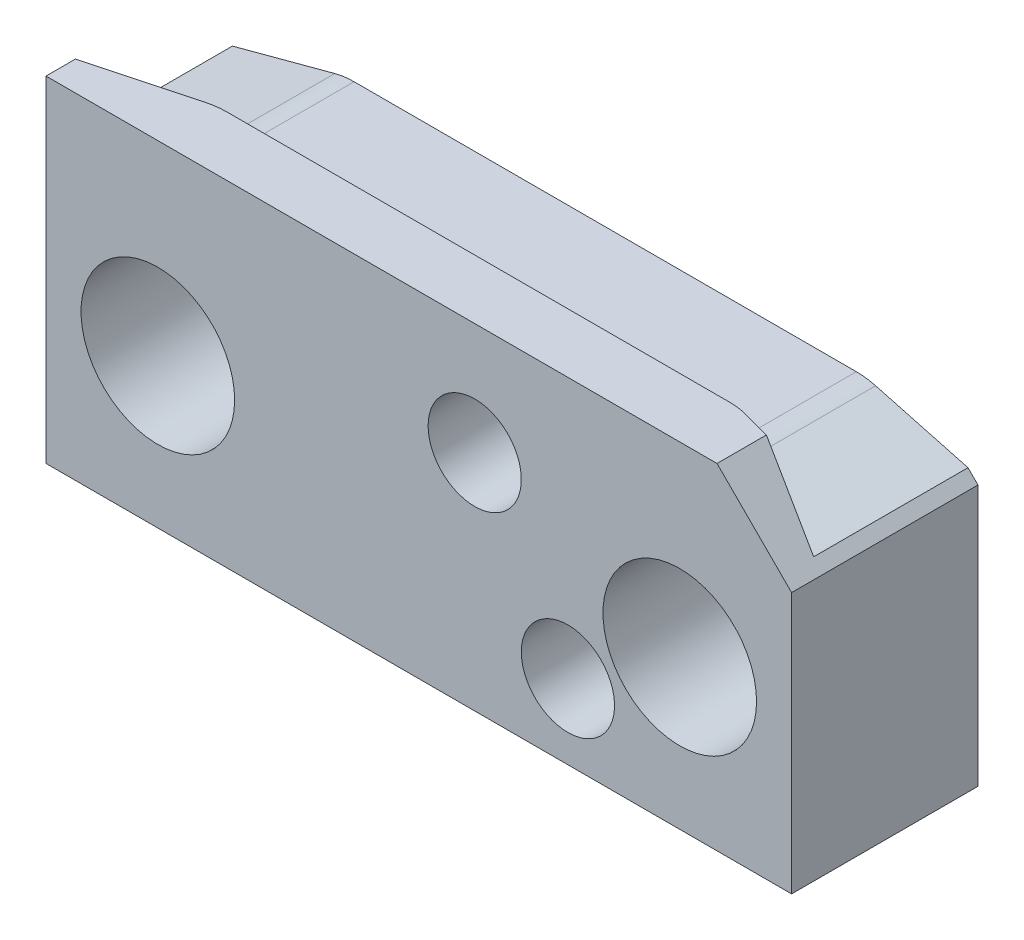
ISO-10303-21;
HEADER;
FILE_DESCRIPTION(('STEP AP214'),'2;1');
FILE_NAME('part.step','',(''),(''),'','','');
FILE_SCHEMA(('AUTOMOTIVE_DESIGN { 1 0 10303 214 1 1 1 1 }'));
ENDSEC;
DATA;
#1=APPLICATION_CONTEXT('core data for automotive mechanical design processes');
#2=APPLICATION_PROTOCOL_DEFINITION('international standard','automotive_design',2000,#1);
#3=PRODUCT_CONTEXT('',#1,'mechanical');
#4=PRODUCT('Part','Part','',(#3));
#5=PRODUCT_RELATED_PRODUCT_CATEGORY('part','',(#4));
#6=PRODUCT_DEFINITION_FORMATION('','',#4);
#7=PRODUCT_DEFINITION_CONTEXT('part definition',#1,'design');
#8=PRODUCT_DEFINITION('design','',#6,#7);
#9=PRODUCT_DEFINITION_SHAPE('','',#8);
#10=(LENGTH_UNIT() NAMED_UNIT(*) SI_UNIT(.MILLI.,.METRE.));
#11=(NAMED_UNIT(*) PLANE_ANGLE_UNIT() SI_UNIT($,.RADIAN.));
#12=(NAMED_UNIT(*) SI_UNIT($,.STERADIAN.) SOLID_ANGLE_UNIT());
#13=UNCERTAINTY_MEASURE_WITH_UNIT(LENGTH_MEASURE(1.E-05),#10,'distance_accuracy_value','');
#14=(GEOMETRIC_REPRESENTATION_CONTEXT(3) GLOBAL_UNCERTAINTY_ASSIGNED_CONTEXT((#13)) GLOBAL_UNIT_ASSIGNED_CONTEXT((#10,
#11,#12)) REPRESENTATION_CONTEXT('',''));
#15=CARTESIAN_POINT('',(0.,0.,0.));
#16=DIRECTION('',(0.,0.,1.));
#17=DIRECTION('',(1.,0.,0.));
#18=AXIS2_PLACEMENT_3D('',#15,#16,#17);
#19=CARTESIAN_POINT('',(-772.795,-79.4506949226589,15.875));
#20=DIRECTION('',(1.,0.,0.));
#21=DIRECTION('',(0.,0.,-1.));
#22=AXIS2_PLACEMENT_3D('',#19,#20,#21);
#23=PLANE('',#22);
#24=DIRECTION('',(0.,0.,-1.));
#25=VECTOR('',#24,1.);
#26=CARTESIAN_POINT('',(-772.795,-73.7234788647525,15.875));
#27=LINE('',#26,#25);
#28=CARTESIAN_POINT('',(-772.795,-73.7234788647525,15.875));
#29=VERTEX_POINT('',#28);
#30=CARTESIAN_POINT('',(-772.795,-73.7234788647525,13.3722160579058));
#31=VERTEX_POINT('',#30);
#32=EDGE_CURVE('E155',#29,#31,#27,.T.);
#33=ORIENTED_EDGE('',*,*,#32,.T.);
#34=DIRECTION('',(0.,-1.,0.));
#35=VECTOR('',#34,1.);
#36=CARTESIAN_POINT('',(-772.795,-79.4506949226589,13.3722160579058));
#37=LINE('',#36,#35);
#38=CARTESIAN_POINT('',(-772.795,-79.4506949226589,13.3722160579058));
#39=VERTEX_POINT('',#38);
#40=EDGE_CURVE('E311',#31,#39,#37,.T.);
#41=ORIENTED_EDGE('',*,*,#40,.T.);
#42=DIRECTION('',(0.,0.,-1.));
#43=VECTOR('',#42,1.);
#44=CARTESIAN_POINT('',(-772.795,-79.4506949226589,15.875));
#45=LINE('',#44,#43);
#46=CARTESIAN_POINT('',(-772.795,-79.4506949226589,0.));
#47=VERTEX_POINT('',#46);
#48=EDGE_CURVE('E197',#39,#47,#45,.T.);
#49=ORIENTED_EDGE('',*,*,#48,.T.);
#50=DIRECTION('',(0.,-1.,0.));
#51=VECTOR('',#50,1.);
#52=CARTESIAN_POINT('',(-772.795,-79.4506949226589,0.));
#53=LINE('',#52,#51);
#54=CARTESIAN_POINT('',(-772.795,-102.298478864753,0.));
#55=VERTEX_POINT('',#54);
#56=EDGE_CURVE('E190',#47,#55,#53,.T.);
#57=ORIENTED_EDGE('',*,*,#56,.T.);
#58=DIRECTION('',(0.,0.,-1.));
#59=VECTOR('',#58,1.);
#60=CARTESIAN_POINT('',(-772.795,-102.298478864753,15.875));
#61=LINE('',#60,#59);
#62=CARTESIAN_POINT('',(-772.795,-102.298478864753,15.875));
#63=VERTEX_POINT('',#62);
#64=EDGE_CURVE('E158',#63,#55,#61,.T.);
#65=ORIENTED_EDGE('',*,*,#64,.F.);
#66=DIRECTION('',(0.,-1.,0.));
#67=VECTOR('',#66,1.);
#68=CARTESIAN_POINT('',(-772.795,-79.4506949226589,15.875));
#69=LINE('',#68,#67);
#70=EDGE_CURVE('E152',#29,#63,#69,.T.);
#71=ORIENTED_EDGE('',*,*,#70,.F.);
#72=EDGE_LOOP('',(#33,#41,#49,#57,#65,#71));
#73=FACE_BOUND('',#72,.T.);
#74=ADVANCED_FACE('F54',(#73),#23,.F.);
#75=CARTESIAN_POINT('',(-709.295,-102.298478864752,15.875));
#76=DIRECTION('',(0.,1.,0.));
#77=DIRECTION('',(-1.,0.,0.));
#78=AXIS2_PLACEMENT_3D('',#75,#76,#77);
#79=PLANE('',#78);
#80=DIRECTION('',(1.,0.,0.));
#81=VECTOR('',#80,1.);
#82=CARTESIAN_POINT('',(-709.295,-102.298478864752,0.));
#83=LINE('',#82,#81);
#84=CARTESIAN_POINT('',(-709.295,-102.298478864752,0.));
#85=VERTEX_POINT('',#84);
#86=EDGE_CURVE('E200',#55,#85,#83,.T.);
#87=ORIENTED_EDGE('',*,*,#86,.T.);
#88=DIRECTION('',(0.,0.,-1.));
#89=VECTOR('',#88,1.);
#90=CARTESIAN_POINT('',(-709.295,-102.298478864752,15.875));
#91=LINE('',#90,#89);
#92=CARTESIAN_POINT('',(-709.295,-102.298478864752,15.875));
#93=VERTEX_POINT('',#92);
#94=EDGE_CURVE('E318',#93,#85,#91,.T.);
#95=ORIENTED_EDGE('',*,*,#94,.F.);
#96=DIRECTION('',(1.,0.,0.));
#97=VECTOR('',#96,1.);
#98=CARTESIAN_POINT('',(-709.295,-102.298478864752,15.875));
#99=LINE('',#98,#97);
#100=EDGE_CURVE('E162',#63,#93,#99,.T.);
#101=ORIENTED_EDGE('',*,*,#100,.F.);
#102=ORIENTED_EDGE('',*,*,#64,.T.);
#103=EDGE_LOOP('',(#87,#95,#101,#102));
#104=FACE_BOUND('',#103,.T.);
#105=ADVANCED_FACE('F392',(#104),#79,.F.);
#106=CARTESIAN_POINT('',(-709.295,-79.4506949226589,15.875));
#107=DIRECTION('',(-1.,0.,0.));
#108=DIRECTION('',(0.,0.,1.));
#109=AXIS2_PLACEMENT_3D('',#106,#107,#108);
#110=PLANE('',#109);
#111=DIRECTION('',(0.,1.,0.));
#112=VECTOR('',#111,1.);
#113=CARTESIAN_POINT('',(-709.295,-79.4506949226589,0.));
#114=LINE('',#113,#112);
#115=CARTESIAN_POINT('',(-709.295,-80.0734788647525,0.));
#116=VERTEX_POINT('',#115);
#117=EDGE_CURVE('E204',#85,#116,#114,.T.);
#118=ORIENTED_EDGE('',*,*,#117,.T.);
#119=DIRECTION('',(0.,0.,1.));
#120=VECTOR('',#119,1.);
#121=CARTESIAN_POINT('',(-709.295,-80.0734788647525,15.875));
#122=LINE('',#121,#120);
#123=CARTESIAN_POINT('',(-709.295,-80.0734788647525,15.875));
#124=VERTEX_POINT('',#123);
#125=EDGE_CURVE('E253',#116,#124,#122,.T.);
#126=ORIENTED_EDGE('',*,*,#125,.T.);
#127=DIRECTION('',(0.,1.,0.));
#128=VECTOR('',#127,1.);
#129=CARTESIAN_POINT('',(-709.295,-79.4506949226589,15.875));
#130=LINE('',#129,#128);
#131=EDGE_CURVE('E194',#93,#124,#130,.T.);
#132=ORIENTED_EDGE('',*,*,#131,.F.);
#133=ORIENTED_EDGE('',*,*,#94,.T.);
#134=EDGE_LOOP('',(#118,#126,#132,#133));
#135=FACE_BOUND('',#134,.T.);
#136=ADVANCED_FACE('F389',(#135),#110,.F.);
#137=CARTESIAN_POINT('',(-709.295,-79.4506949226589,15.875));
#138=DIRECTION('',(-0.258819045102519,-0.965925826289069,0.));
#139=DIRECTION('',(0.965925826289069,-0.258819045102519,0.));
#140=AXIS2_PLACEMENT_3D('',#137,#138,#139);
#141=PLANE('',#140);
#142=DIRECTION('',(0.93511312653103,-0.25056280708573,0.25056280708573));
#143=VECTOR('',#142,1.);
#144=CARTESIAN_POINT('',(-708.708586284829,-79.6078240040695,13.5293451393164));
#145=LINE('',#144,#143);
#146=CARTESIAN_POINT('',(-718.012492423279,-77.1148498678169,11.0363710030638));
#147=VERTEX_POINT('',#146);
#148=CARTESIAN_POINT('',(-710.145738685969,-79.2227401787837,13.1442613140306));
#149=VERTEX_POINT('',#148);
#150=EDGE_CURVE('E295',#147,#149,#145,.T.);
#151=ORIENTED_EDGE('',*,*,#150,.T.);
#152=DIRECTION('',(0.,0.,-1.));
#153=VECTOR('',#152,1.);
#154=CARTESIAN_POINT('',(-710.145738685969,-79.2227401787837,15.875));
#155=LINE('',#154,#153);
#156=CARTESIAN_POINT('',(-710.145738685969,-79.2227401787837,0.));
#157=VERTEX_POINT('',#156);
#158=EDGE_CURVE('E64',#149,#157,#155,.T.);
#159=ORIENTED_EDGE('',*,*,#158,.T.);
#160=DIRECTION('',(-0.965925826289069,0.258819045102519,0.));
#161=VECTOR('',#160,1.);
#162=CARTESIAN_POINT('',(-709.295,-79.4506949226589,0.));
#163=LINE('',#162,#161);
#164=CARTESIAN_POINT('',(-718.012492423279,-77.1148498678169,0.));
#165=VERTEX_POINT('',#164);
#166=EDGE_CURVE('E208',#157,#165,#163,.T.);
#167=ORIENTED_EDGE('',*,*,#166,.T.);
#168=DIRECTION('',(0.,0.,-1.));
#169=VECTOR('',#168,1.);
#170=CARTESIAN_POINT('',(-718.012492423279,-77.1148498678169,15.875));
#171=LINE('',#170,#169);
#172=EDGE_CURVE('E322',#147,#165,#171,.T.);
#173=ORIENTED_EDGE('',*,*,#172,.F.);
#174=EDGE_LOOP('',(#151,#159,#167,#173));
#175=FACE_BOUND('',#174,.T.);
#176=ADVANCED_FACE('F416',(#175),#141,.F.);
#177=CARTESIAN_POINT('',(-719.65599335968,-83.2484788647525,15.875));
#178=DIRECTION('',(0.,0.,-1.));
#179=DIRECTION('',(-1.,0.,0.));
#180=AXIS2_PLACEMENT_3D('',#177,#178,#179);
#181=CYLINDRICAL_SURFACE('',#180,6.35);
#182=DIRECTION('',(0.,0.,-1.));
#183=VECTOR('',#182,1.);
#184=CARTESIAN_POINT('',(-719.65599335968,-76.8984788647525,15.875));
#185=LINE('',#184,#183);
#186=CARTESIAN_POINT('',(-719.65599335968,-76.8984788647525,10.8199999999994));
#187=VERTEX_POINT('',#186);
#188=CARTESIAN_POINT('',(-719.65599335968,-76.8984788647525,0.));
#189=VERTEX_POINT('',#188);
#190=EDGE_CURVE('E327',#187,#189,#185,.T.);
#191=ORIENTED_EDGE('',*,*,#190,.F.);
#192=CARTESIAN_POINT('',(-719.65599335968,-83.2484788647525,17.1699999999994));
#193=DIRECTION('',(0.,-0.707106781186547,-0.707106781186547));
#194=DIRECTION('',(0.,0.707106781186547,-0.707106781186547));
#195=AXIS2_PLACEMENT_3D('',#192,#193,#194);
#196=ELLIPSE('',#195,8.98025612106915,6.35);
#197=EDGE_CURVE('E247',#187,#147,#196,.T.);
#198=ORIENTED_EDGE('',*,*,#197,.T.);
#199=ORIENTED_EDGE('',*,*,#172,.T.);
#200=CARTESIAN_POINT('',(-719.65599335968,-83.2484788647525,0.));
#201=DIRECTION('',(0.,0.,1.));
#202=DIRECTION('',(1.,0.,0.));
#203=AXIS2_PLACEMENT_3D('',#200,#201,#202);
#204=CIRCLE('',#203,6.35);
#205=EDGE_CURVE('E211',#165,#189,#204,.T.);
#206=ORIENTED_EDGE('',*,*,#205,.T.);
#207=EDGE_LOOP('',(#191,#198,#199,#206));
#208=FACE_BOUND('',#207,.T.);
#209=ADVANCED_FACE('F381',(#208),#181,.T.);
#210=CARTESIAN_POINT('',(-719.65599335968,-76.8984788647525,15.875));
#211=DIRECTION('',(0.,-1.,0.));
#212=DIRECTION('',(1.,0.,0.));
#213=AXIS2_PLACEMENT_3D('',#210,#211,#212);
#214=PLANE('',#213);
#215=DIRECTION('',(0.,0.,-1.));
#216=VECTOR('',#215,1.);
#217=CARTESIAN_POINT('',(-762.43400664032,-76.8984788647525,15.875));
#218=LINE('',#217,#216);
#219=CARTESIAN_POINT('',(-762.43400664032,-76.8984788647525,10.8199999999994));
#220=VERTEX_POINT('',#219);
#221=CARTESIAN_POINT('',(-762.43400664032,-76.8984788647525,0.));
#222=VERTEX_POINT('',#221);
#223=EDGE_CURVE('E232',#220,#222,#218,.T.);
#224=ORIENTED_EDGE('',*,*,#223,.F.);
#225=DIRECTION('',(1.,0.,0.));
#226=VECTOR('',#225,1.);
#227=CARTESIAN_POINT('',(-719.65599335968,-76.8984788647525,10.8199999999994));
#228=LINE('',#227,#226);
#229=EDGE_CURVE('E173',#220,#187,#228,.T.);
#230=ORIENTED_EDGE('',*,*,#229,.T.);
#231=ORIENTED_EDGE('',*,*,#190,.T.);
#232=DIRECTION('',(-1.,0.,0.));
#233=VECTOR('',#232,1.);
#234=CARTESIAN_POINT('',(-719.65599335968,-76.8984788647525,0.));
#235=LINE('',#234,#233);
#236=EDGE_CURVE('E215',#189,#222,#235,.T.);
#237=ORIENTED_EDGE('',*,*,#236,.T.);
#238=EDGE_LOOP('',(#224,#230,#231,#237));
#239=FACE_BOUND('',#238,.T.);
#240=ADVANCED_FACE('F358',(#239),#214,.F.);
#241=CARTESIAN_POINT('',(-762.43400664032,-83.2484788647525,15.875));
#242=DIRECTION('',(0.,0.,-1.));
#243=DIRECTION('',(-1.,0.,0.));
#244=AXIS2_PLACEMENT_3D('',#241,#242,#243);
#245=CYLINDRICAL_SURFACE('',#244,6.35);
#246=DIRECTION('',(0.,0.,-1.));
#247=VECTOR('',#246,1.);
#248=CARTESIAN_POINT('',(-764.077507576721,-77.1148498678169,15.875));
#249=LINE('',#248,#247);
#250=CARTESIAN_POINT('',(-764.077507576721,-77.1148498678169,11.0363710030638));
#251=VERTEX_POINT('',#250);
#252=CARTESIAN_POINT('',(-764.077507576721,-77.1148498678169,0.));
#253=VERTEX_POINT('',#252);
#254=EDGE_CURVE('E228',#251,#253,#249,.T.);
#255=ORIENTED_EDGE('',*,*,#254,.F.);
#256=CARTESIAN_POINT('',(-762.43400664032,-83.2484788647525,17.1699999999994));
#257=DIRECTION('',(0.,-0.707106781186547,-0.707106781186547));
#258=DIRECTION('',(0.,0.707106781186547,-0.707106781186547));
#259=AXIS2_PLACEMENT_3D('',#256,#257,#258);
#260=ELLIPSE('',#259,8.98025612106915,6.35);
#261=EDGE_CURVE('E243',#251,#220,#260,.T.);
#262=ORIENTED_EDGE('',*,*,#261,.T.);
#263=ORIENTED_EDGE('',*,*,#223,.T.);
#264=CARTESIAN_POINT('',(-762.43400664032,-83.2484788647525,0.));
#265=DIRECTION('',(0.,0.,1.));
#266=DIRECTION('',(-1.,0.,0.));
#267=AXIS2_PLACEMENT_3D('',#264,#265,#266);
#268=CIRCLE('',#267,6.35);
#269=EDGE_CURVE('E219',#222,#253,#268,.T.);
#270=ORIENTED_EDGE('',*,*,#269,.T.);
#271=EDGE_LOOP('',(#255,#262,#263,#270));
#272=FACE_BOUND('',#271,.T.);
#273=ADVANCED_FACE('F350',(#272),#245,.T.);
#274=CARTESIAN_POINT('',(-764.077507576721,-77.1148498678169,15.875));
#275=DIRECTION('',(0.258819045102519,-0.965925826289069,0.));
#276=DIRECTION('',(0.965925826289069,0.258819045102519,0.));
#277=AXIS2_PLACEMENT_3D('',#274,#275,#276);
#278=PLANE('',#277);
#279=ORIENTED_EDGE('',*,*,#48,.F.);
#280=DIRECTION('',(0.93511312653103,0.25056280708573,-0.25056280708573));
#281=VECTOR('',#280,1.);
#282=CARTESIAN_POINT('',(-765.211220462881,-77.4186273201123,11.3401484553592));
#283=LINE('',#282,#281);
#284=EDGE_CURVE('E299',#39,#251,#283,.T.);
#285=ORIENTED_EDGE('',*,*,#284,.T.);
#286=ORIENTED_EDGE('',*,*,#254,.T.);
#287=DIRECTION('',(-0.965925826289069,-0.258819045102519,0.));
#288=VECTOR('',#287,1.);
#289=CARTESIAN_POINT('',(-764.077507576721,-77.1148498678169,0.));
#290=LINE('',#289,#288);
#291=EDGE_CURVE('E163',#253,#47,#290,.T.);
#292=ORIENTED_EDGE('',*,*,#291,.T.);
#293=EDGE_LOOP('',(#279,#285,#286,#292));
#294=FACE_BOUND('',#293,.T.);
#295=ADVANCED_FACE('F366',(#294),#278,.F.);
#296=CARTESIAN_POINT('',(-719.65599335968,-83.2484788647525,15.875));
#297=DIRECTION('',(0.,0.,1.));
#298=DIRECTION('',(1.,0.,0.));
#299=AXIS2_PLACEMENT_3D('',#296,#297,#298);
#300=PLANE('',#299);
#301=CARTESIAN_POINT('',(-728.345,-95.9484788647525,15.875));
#302=DIRECTION('',(0.,0.,-1.));
#303=DIRECTION('',(-1.,0.,0.));
#304=AXIS2_PLACEMENT_3D('',#301,#302,#303);
#305=CIRCLE('',#304,3.96874999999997);
#306=CARTESIAN_POINT('',(-732.31375,-95.9484788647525,15.875));
#307=VERTEX_POINT('',#306);
#308=EDGE_CURVE('E470',#307,#307,#305,.T.);
#309=ORIENTED_EDGE('',*,*,#308,.T.);
#310=EDGE_LOOP('',(#309));
#311=FACE_BOUND('',#310,.T.);
#312=CARTESIAN_POINT('',(-736.2825,-83.2484788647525,15.875));
#313=DIRECTION('',(0.,0.,-1.));
#314=DIRECTION('',(-1.,0.,0.));
#315=AXIS2_PLACEMENT_3D('',#312,#313,#314);
#316=CIRCLE('',#315,3.96874999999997);
#317=CARTESIAN_POINT('',(-740.25125,-83.2484788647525,15.875));
#318=VERTEX_POINT('',#317);
#319=EDGE_CURVE('E475',#318,#318,#316,.T.);
#320=ORIENTED_EDGE('',*,*,#319,.T.);
#321=EDGE_LOOP('',(#320));
#322=FACE_BOUND('',#321,.T.);
#323=CARTESIAN_POINT('',(-718.82,-89.5984788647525,15.875));
#324=DIRECTION('',(0.,0.,1.));
#325=DIRECTION('',(1.,0.,0.));
#326=AXIS2_PLACEMENT_3D('',#323,#324,#325);
#327=CIRCLE('',#326,6.54049999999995);
#328=CARTESIAN_POINT('',(-712.2795,-89.5984788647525,15.875));
#329=VERTEX_POINT('',#328);
#330=EDGE_CURVE('E507',#329,#329,#327,.T.);
#331=ORIENTED_EDGE('',*,*,#330,.F.);
#332=EDGE_LOOP('',(#331));
#333=FACE_BOUND('',#332,.T.);
#334=CARTESIAN_POINT('',(-763.27,-89.5984788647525,15.875));
#335=DIRECTION('',(0.,0.,1.));
#336=DIRECTION('',(1.,0.,0.));
#337=AXIS2_PLACEMENT_3D('',#334,#335,#336);
#338=CIRCLE('',#337,6.54049999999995);
#339=CARTESIAN_POINT('',(-756.7295,-89.5984788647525,15.875));
#340=VERTEX_POINT('',#339);
#341=EDGE_CURVE('E184',#340,#340,#338,.T.);
#342=ORIENTED_EDGE('',*,*,#341,.F.);
#343=EDGE_LOOP('',(#342));
#344=FACE_BOUND('',#343,.T.);
#345=ORIENTED_EDGE('',*,*,#131,.T.);
#346=DIRECTION('',(-0.707106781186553,0.707106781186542,0.));
#347=VECTOR('',#346,1.);
#348=CARTESIAN_POINT('',(-712.88799667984,-76.4804821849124,15.875));
#349=LINE('',#348,#347);
#350=CARTESIAN_POINT('',(-715.645,-73.7234788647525,15.875));
#351=VERTEX_POINT('',#350);
#352=EDGE_CURVE('E177',#124,#351,#349,.T.);
#353=ORIENTED_EDGE('',*,*,#352,.T.);
#354=DIRECTION('',(1.,0.,0.));
#355=VECTOR('',#354,1.);
#356=CARTESIAN_POINT('',(-801.813677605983,-73.7234788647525,15.875));
#357=LINE('',#356,#355);
#358=EDGE_CURVE('E168',#29,#351,#357,.T.);
#359=ORIENTED_EDGE('',*,*,#358,.F.);
#360=ORIENTED_EDGE('',*,*,#70,.T.);
#361=ORIENTED_EDGE('',*,*,#100,.T.);
#362=EDGE_LOOP('',(#345,#353,#359,#360,#361));
#363=FACE_BOUND('',#362,.T.);
#364=ADVANCED_FACE('F176',(#311,#322,#333,#344,#363),#300,.T.);
#365=CARTESIAN_POINT('',(-719.65599335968,-83.2484788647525,0.));
#366=DIRECTION('',(0.,0.,1.));
#367=DIRECTION('',(1.,0.,0.));
#368=AXIS2_PLACEMENT_3D('',#365,#366,#367);
#369=PLANE('',#368);
#370=CARTESIAN_POINT('',(-728.345,-95.9484788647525,0.));
#371=DIRECTION('',(0.,0.,-1.));
#372=DIRECTION('',(-1.,0.,0.));
#373=AXIS2_PLACEMENT_3D('',#370,#371,#372);
#374=CIRCLE('',#373,3.96874999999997);
#375=CARTESIAN_POINT('',(-732.31375,-95.9484788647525,0.));
#376=VERTEX_POINT('',#375);
#377=EDGE_CURVE('E473',#376,#376,#374,.T.);
#378=ORIENTED_EDGE('',*,*,#377,.F.);
#379=EDGE_LOOP('',(#378));
#380=FACE_BOUND('',#379,.T.);
#381=CARTESIAN_POINT('',(-736.2825,-83.2484788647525,0.));
#382=DIRECTION('',(0.,0.,-1.));
#383=DIRECTION('',(-1.,0.,0.));
#384=AXIS2_PLACEMENT_3D('',#381,#382,#383);
#385=CIRCLE('',#384,3.96874999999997);
#386=CARTESIAN_POINT('',(-740.25125,-83.2484788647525,0.));
#387=VERTEX_POINT('',#386);
#388=EDGE_CURVE('E480',#387,#387,#385,.T.);
#389=ORIENTED_EDGE('',*,*,#388,.F.);
#390=EDGE_LOOP('',(#389));
#391=FACE_BOUND('',#390,.T.);
#392=CARTESIAN_POINT('',(-718.82,-89.5984788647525,0.));
#393=DIRECTION('',(0.,0.,1.));
#394=DIRECTION('',(1.,0.,0.));
#395=AXIS2_PLACEMENT_3D('',#392,#393,#394);
#396=CIRCLE('',#395,4.36879999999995);
#397=CARTESIAN_POINT('',(-714.4512,-89.5984788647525,0.));
#398=VERTEX_POINT('',#397);
#399=EDGE_CURVE('E501',#398,#398,#396,.T.);
#400=ORIENTED_EDGE('',*,*,#399,.T.);
#401=EDGE_LOOP('',(#400));
#402=FACE_BOUND('',#401,.T.);
#403=CARTESIAN_POINT('',(-763.27,-89.5984788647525,0.));
#404=DIRECTION('',(0.,0.,1.));
#405=DIRECTION('',(1.,0.,0.));
#406=AXIS2_PLACEMENT_3D('',#403,#404,#405);
#407=CIRCLE('',#406,4.36879999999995);
#408=CARTESIAN_POINT('',(-758.9012,-89.5984788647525,0.));
#409=VERTEX_POINT('',#408);
#410=EDGE_CURVE('E521',#409,#409,#407,.T.);
#411=ORIENTED_EDGE('',*,*,#410,.T.);
#412=EDGE_LOOP('',(#411));
#413=FACE_BOUND('',#412,.T.);
#414=ORIENTED_EDGE('',*,*,#166,.F.);
#415=DIRECTION('',(0.707106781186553,-0.707106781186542,0.));
#416=VECTOR('',#415,1.);
#417=CARTESIAN_POINT('',(-709.295,-80.0734788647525,0.));
#418=LINE('',#417,#416);
#419=EDGE_CURVE('E12',#157,#116,#418,.T.);
#420=ORIENTED_EDGE('',*,*,#419,.T.);
#421=ORIENTED_EDGE('',*,*,#117,.F.);
#422=ORIENTED_EDGE('',*,*,#86,.F.);
#423=ORIENTED_EDGE('',*,*,#56,.F.);
#424=ORIENTED_EDGE('',*,*,#291,.F.);
#425=ORIENTED_EDGE('',*,*,#269,.F.);
#426=ORIENTED_EDGE('',*,*,#236,.F.);
#427=ORIENTED_EDGE('',*,*,#205,.F.);
#428=EDGE_LOOP('',(#414,#420,#421,#422,#423,#424,#425,#426,#427));
#429=FACE_BOUND('',#428,.T.);
#430=ADVANCED_FACE('F362',(#380,#391,#402,#413,#429),#369,.F.);
#431=CARTESIAN_POINT('',(-801.813677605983,-102.298478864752,10.8199999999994));
#432=DIRECTION('',(0.,0.,-1.));
#433=DIRECTION('',(-1.,0.,0.));
#434=AXIS2_PLACEMENT_3D('',#431,#432,#433);
#435=PLANE('',#434);
#436=ORIENTED_EDGE('',*,*,#229,.F.);
#437=DIRECTION('',(0.,1.,0.));
#438=VECTOR('',#437,1.);
#439=CARTESIAN_POINT('',(-762.43400664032,-102.298478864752,10.8199999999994));
#440=LINE('',#439,#438);
#441=CARTESIAN_POINT('',(-762.43400664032,-73.7234788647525,10.8199999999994));
#442=VERTEX_POINT('',#441);
#443=EDGE_CURVE('E286',#220,#442,#440,.T.);
#444=ORIENTED_EDGE('',*,*,#443,.T.);
#445=DIRECTION('',(1.,0.,0.));
#446=VECTOR('',#445,1.);
#447=CARTESIAN_POINT('',(-801.813677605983,-73.7234788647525,10.8199999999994));
#448=LINE('',#447,#446);
#449=CARTESIAN_POINT('',(-719.65599335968,-73.7234788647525,10.8199999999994));
#450=VERTEX_POINT('',#449);
#451=EDGE_CURVE('E179',#442,#450,#448,.T.);
#452=ORIENTED_EDGE('',*,*,#451,.T.);
#453=DIRECTION('',(0.,-1.,0.));
#454=VECTOR('',#453,1.);
#455=CARTESIAN_POINT('',(-719.65599335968,-102.298478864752,10.8199999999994));
#456=LINE('',#455,#454);
#457=EDGE_CURVE('E290',#450,#187,#456,.T.);
#458=ORIENTED_EDGE('',*,*,#457,.T.);
#459=EDGE_LOOP('',(#436,#444,#452,#458));
#460=FACE_BOUND('',#459,.T.);
#461=ADVANCED_FACE('F374',(#460),#435,.T.);
#462=CARTESIAN_POINT('',(-801.813677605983,-73.7234788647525,15.875));
#463=DIRECTION('',(0.,1.,0.));
#464=DIRECTION('',(0.,0.,1.));
#465=AXIS2_PLACEMENT_3D('',#462,#463,#464);
#466=PLANE('',#465);
#467=ORIENTED_EDGE('',*,*,#358,.T.);
#468=DIRECTION('',(0.,0.,-1.));
#469=VECTOR('',#468,1.);
#470=CARTESIAN_POINT('',(-715.645,-73.7234788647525,13.3722160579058));
#471=LINE('',#470,#469);
#472=CARTESIAN_POINT('',(-715.645,-73.7234788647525,11.6707386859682));
#473=VERTEX_POINT('',#472);
#474=EDGE_CURVE('E259',#351,#473,#471,.T.);
#475=ORIENTED_EDGE('',*,*,#474,.T.);
#476=DIRECTION('',(-0.965925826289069,0.,-0.258819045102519));
#477=VECTOR('',#476,1.);
#478=CARTESIAN_POINT('',(-794.99040538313,-73.7234788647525,-9.58979860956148));
#479=LINE('',#478,#477);
#480=CARTESIAN_POINT('',(-718.012492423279,-73.7234788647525,11.0363710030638));
#481=VERTEX_POINT('',#480);
#482=EDGE_CURVE('E307',#473,#481,#479,.T.);
#483=ORIENTED_EDGE('',*,*,#482,.T.);
#484=CARTESIAN_POINT('',(-719.65599335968,-73.7234788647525,17.1699999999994));
#485=DIRECTION('',(0.,1.,0.));
#486=DIRECTION('',(0.,0.,1.));
#487=AXIS2_PLACEMENT_3D('',#484,#485,#486);
#488=CIRCLE('',#487,6.35);
#489=EDGE_CURVE('E282',#481,#450,#488,.T.);
#490=ORIENTED_EDGE('',*,*,#489,.T.);
#491=ORIENTED_EDGE('',*,*,#451,.F.);
#492=CARTESIAN_POINT('',(-762.43400664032,-73.7234788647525,17.1699999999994));
#493=DIRECTION('',(0.,1.,0.));
#494=DIRECTION('',(0.,0.,1.));
#495=AXIS2_PLACEMENT_3D('',#492,#493,#494);
#496=CIRCLE('',#495,6.35);
#497=CARTESIAN_POINT('',(-764.077507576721,-73.7234788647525,11.0363710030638));
#498=VERTEX_POINT('',#497);
#499=EDGE_CURVE('E279',#442,#498,#496,.T.);
#500=ORIENTED_EDGE('',*,*,#499,.T.);
#501=DIRECTION('',(-0.965925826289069,0.,0.258819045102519));
#502=VECTOR('',#501,1.);
#503=CARTESIAN_POINT('',(-800.495490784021,-73.7234788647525,20.7945401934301));
#504=LINE('',#503,#502);
#505=EDGE_CURVE('E171',#498,#31,#504,.T.);
#506=ORIENTED_EDGE('',*,*,#505,.T.);
#507=ORIENTED_EDGE('',*,*,#32,.F.);
#508=EDGE_LOOP('',(#467,#475,#483,#490,#491,#500,#506,#507));
#509=FACE_BOUND('',#508,.T.);
#510=ADVANCED_FACE('F167',(#509),#466,.T.);
#511=CARTESIAN_POINT('',(-772.795,-79.4506949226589,13.3722160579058));
#512=DIRECTION('',(-0.258819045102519,0.,-0.965925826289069));
#513=DIRECTION('',(0.,1.,0.));
#514=AXIS2_PLACEMENT_3D('',#511,#512,#513);
#515=PLANE('',#514);
#516=ORIENTED_EDGE('',*,*,#505,.F.);
#517=DIRECTION('',(0.,1.,0.));
#518=VECTOR('',#517,1.);
#519=CARTESIAN_POINT('',(-764.077507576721,-79.4506949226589,11.0363710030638));
#520=LINE('',#519,#518);
#521=EDGE_CURVE('E276',#498,#251,#520,.F.);
#522=ORIENTED_EDGE('',*,*,#521,.T.);
#523=ORIENTED_EDGE('',*,*,#284,.F.);
#524=ORIENTED_EDGE('',*,*,#40,.F.);
#525=EDGE_LOOP('',(#516,#522,#523,#524));
#526=FACE_BOUND('',#525,.T.);
#527=ADVANCED_FACE('F393',(#526),#515,.T.);
#528=CARTESIAN_POINT('',(-709.295,-79.4506949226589,13.3722160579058));
#529=DIRECTION('',(0.258819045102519,0.,-0.965925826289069));
#530=DIRECTION('',(0.,-1.,0.));
#531=AXIS2_PLACEMENT_3D('',#528,#529,#530);
#532=PLANE('',#531);
#533=ORIENTED_EDGE('',*,*,#482,.F.);
#534=DIRECTION('',(0.694746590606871,-0.69474659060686,0.186156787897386));
#535=VECTOR('',#534,1.);
#536=CARTESIAN_POINT('',(-709.595600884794,-79.772877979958,13.2916702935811));
#537=LINE('',#536,#535);
#538=EDGE_CURVE('E78',#473,#149,#537,.T.);
#539=ORIENTED_EDGE('',*,*,#538,.T.);
#540=ORIENTED_EDGE('',*,*,#150,.F.);
#541=DIRECTION('',(0.,-1.,0.));
#542=VECTOR('',#541,1.);
#543=CARTESIAN_POINT('',(-718.012492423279,-79.4506949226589,11.0363710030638));
#544=LINE('',#543,#542);
#545=EDGE_CURVE('E248',#147,#481,#544,.F.);
#546=ORIENTED_EDGE('',*,*,#545,.T.);
#547=EDGE_LOOP('',(#533,#539,#540,#546));
#548=FACE_BOUND('',#547,.T.);
#549=ADVANCED_FACE('F395',(#548),#532,.T.);
#550=CARTESIAN_POINT('',(-762.43400664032,-102.298478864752,17.1699999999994));
#551=DIRECTION('',(0.,1.,0.));
#552=DIRECTION('',(0.,0.,1.));
#553=AXIS2_PLACEMENT_3D('',#550,#551,#552);
#554=CYLINDRICAL_SURFACE('',#553,6.35);
#555=ORIENTED_EDGE('',*,*,#261,.F.);
#556=ORIENTED_EDGE('',*,*,#521,.F.);
#557=ORIENTED_EDGE('',*,*,#499,.F.);
#558=ORIENTED_EDGE('',*,*,#443,.F.);
#559=EDGE_LOOP('',(#555,#556,#557,#558));
#560=FACE_BOUND('',#559,.T.);
#561=ADVANCED_FACE('F371',(#560),#554,.T.);
#562=CARTESIAN_POINT('',(-719.65599335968,-102.298478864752,17.1699999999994));
#563=DIRECTION('',(0.,-1.,0.));
#564=DIRECTION('',(0.,0.,-1.));
#565=AXIS2_PLACEMENT_3D('',#562,#563,#564);
#566=CYLINDRICAL_SURFACE('',#565,6.35);
#567=ORIENTED_EDGE('',*,*,#489,.F.);
#568=ORIENTED_EDGE('',*,*,#545,.F.);
#569=ORIENTED_EDGE('',*,*,#197,.F.);
#570=ORIENTED_EDGE('',*,*,#457,.F.);
#571=EDGE_LOOP('',(#567,#568,#569,#570));
#572=FACE_BOUND('',#571,.T.);
#573=ADVANCED_FACE('F379',(#572),#566,.T.);
#574=CARTESIAN_POINT('',(-763.27,-89.5984788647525,15.875));
#575=DIRECTION('',(0.,0.,1.));
#576=DIRECTION('',(1.,0.,0.));
#577=AXIS2_PLACEMENT_3D('',#574,#575,#576);
#578=CYLINDRICAL_SURFACE('',#577,6.54049999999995);
#579=CARTESIAN_POINT('',(-763.27,-89.5984788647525,6.223));
#580=DIRECTION('',(0.,0.,1.));
#581=DIRECTION('',(1.,0.,0.));
#582=AXIS2_PLACEMENT_3D('',#579,#580,#581);
#583=CIRCLE('',#582,6.54049999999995);
#584=CARTESIAN_POINT('',(-756.7295,-89.5984788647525,6.223));
#585=VERTEX_POINT('',#584);
#586=EDGE_CURVE('E520',#585,#585,#583,.T.);
#587=ORIENTED_EDGE('',*,*,#586,.F.);
#588=EDGE_LOOP('',(#587));
#589=FACE_BOUND('',#588,.T.);
#590=ORIENTED_EDGE('',*,*,#341,.T.);
#591=EDGE_LOOP('',(#590));
#592=FACE_BOUND('',#591,.T.);
#593=ADVANCED_FACE('F433',(#589,#592),#578,.F.);
#594=CARTESIAN_POINT('',(-758.9012,-89.5984788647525,6.223));
#595=DIRECTION('',(0.,0.,-1.));
#596=DIRECTION('',(-1.,0.,0.));
#597=AXIS2_PLACEMENT_3D('',#594,#595,#596);
#598=PLANE('',#597);
#599=CARTESIAN_POINT('',(-763.27,-89.5984788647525,6.223));
#600=DIRECTION('',(0.,0.,1.));
#601=DIRECTION('',(1.,0.,0.));
#602=AXIS2_PLACEMENT_3D('',#599,#600,#601);
#603=CIRCLE('',#602,4.36879999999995);
#604=CARTESIAN_POINT('',(-758.9012,-89.5984788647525,6.223));
#605=VERTEX_POINT('',#604);
#606=EDGE_CURVE('E515',#605,#605,#603,.T.);
#607=ORIENTED_EDGE('',*,*,#606,.F.);
#608=EDGE_LOOP('',(#607));
#609=FACE_BOUND('',#608,.T.);
#610=ORIENTED_EDGE('',*,*,#586,.T.);
#611=EDGE_LOOP('',(#610));
#612=FACE_BOUND('',#611,.T.);
#613=ADVANCED_FACE('F436',(#609,#612),#598,.F.);
#614=CARTESIAN_POINT('',(-763.27,-89.5984788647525,15.875));
#615=DIRECTION('',(0.,0.,1.));
#616=DIRECTION('',(1.,0.,0.));
#617=AXIS2_PLACEMENT_3D('',#614,#615,#616);
#618=CYLINDRICAL_SURFACE('',#617,4.36879999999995);
#619=ORIENTED_EDGE('',*,*,#410,.F.);
#620=EDGE_LOOP('',(#619));
#621=FACE_BOUND('',#620,.T.);
#622=ORIENTED_EDGE('',*,*,#606,.T.);
#623=EDGE_LOOP('',(#622));
#624=FACE_BOUND('',#623,.T.);
#625=ADVANCED_FACE('F440',(#621,#624),#618,.F.);
#626=CARTESIAN_POINT('',(-718.82,-89.5984788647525,15.875));
#627=DIRECTION('',(0.,0.,1.));
#628=DIRECTION('',(1.,0.,0.));
#629=AXIS2_PLACEMENT_3D('',#626,#627,#628);
#630=CYLINDRICAL_SURFACE('',#629,6.54049999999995);
#631=CARTESIAN_POINT('',(-718.82,-89.5984788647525,6.223));
#632=DIRECTION('',(0.,0.,1.));
#633=DIRECTION('',(1.,0.,0.));
#634=AXIS2_PLACEMENT_3D('',#631,#632,#633);
#635=CIRCLE('',#634,6.54049999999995);
#636=CARTESIAN_POINT('',(-712.2795,-89.5984788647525,6.223));
#637=VERTEX_POINT('',#636);
#638=EDGE_CURVE('E500',#637,#637,#635,.T.);
#639=ORIENTED_EDGE('',*,*,#638,.F.);
#640=EDGE_LOOP('',(#639));
#641=FACE_BOUND('',#640,.T.);
#642=ORIENTED_EDGE('',*,*,#330,.T.);
#643=EDGE_LOOP('',(#642));
#644=FACE_BOUND('',#643,.T.);
#645=ADVANCED_FACE('F444',(#641,#644),#630,.F.);
#646=CARTESIAN_POINT('',(-714.4512,-89.5984788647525,6.223));
#647=DIRECTION('',(0.,0.,-1.));
#648=DIRECTION('',(-1.,0.,0.));
#649=AXIS2_PLACEMENT_3D('',#646,#647,#648);
#650=PLANE('',#649);
#651=CARTESIAN_POINT('',(-718.82,-89.5984788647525,6.223));
#652=DIRECTION('',(0.,0.,1.));
#653=DIRECTION('',(1.,0.,0.));
#654=AXIS2_PLACEMENT_3D('',#651,#652,#653);
#655=CIRCLE('',#654,4.36879999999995);
#656=CARTESIAN_POINT('',(-714.4512,-89.5984788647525,6.223));
#657=VERTEX_POINT('',#656);
#658=EDGE_CURVE('E495',#657,#657,#655,.T.);
#659=ORIENTED_EDGE('',*,*,#658,.F.);
#660=EDGE_LOOP('',(#659));
#661=FACE_BOUND('',#660,.T.);
#662=ORIENTED_EDGE('',*,*,#638,.T.);
#663=EDGE_LOOP('',(#662));
#664=FACE_BOUND('',#663,.T.);
#665=ADVANCED_FACE('F448',(#661,#664),#650,.F.);
#666=CARTESIAN_POINT('',(-718.82,-89.5984788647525,15.875));
#667=DIRECTION('',(0.,0.,1.));
#668=DIRECTION('',(1.,0.,0.));
#669=AXIS2_PLACEMENT_3D('',#666,#667,#668);
#670=CYLINDRICAL_SURFACE('',#669,4.36879999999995);
#671=ORIENTED_EDGE('',*,*,#399,.F.);
#672=EDGE_LOOP('',(#671));
#673=FACE_BOUND('',#672,.T.);
#674=ORIENTED_EDGE('',*,*,#658,.T.);
#675=EDGE_LOOP('',(#674));
#676=FACE_BOUND('',#675,.T.);
#677=ADVANCED_FACE('F452',(#673,#676),#670,.F.);
#678=CARTESIAN_POINT('',(-736.2825,-83.2484788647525,0.));
#679=DIRECTION('',(0.,0.,-1.));
#680=DIRECTION('',(-1.,0.,0.));
#681=AXIS2_PLACEMENT_3D('',#678,#679,#680);
#682=CYLINDRICAL_SURFACE('',#681,3.96874999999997);
#683=ORIENTED_EDGE('',*,*,#319,.F.);
#684=EDGE_LOOP('',(#683));
#685=FACE_BOUND('',#684,.T.);
#686=ORIENTED_EDGE('',*,*,#388,.T.);
#687=EDGE_LOOP('',(#686));
#688=FACE_BOUND('',#687,.T.);
#689=ADVANCED_FACE('F456',(#685,#688),#682,.F.);
#690=CARTESIAN_POINT('',(-728.345,-95.9484788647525,0.));
#691=DIRECTION('',(0.,0.,-1.));
#692=DIRECTION('',(-1.,0.,0.));
#693=AXIS2_PLACEMENT_3D('',#690,#691,#692);
#694=CYLINDRICAL_SURFACE('',#693,3.96874999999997);
#695=ORIENTED_EDGE('',*,*,#308,.F.);
#696=EDGE_LOOP('',(#695));
#697=FACE_BOUND('',#696,.T.);
#698=ORIENTED_EDGE('',*,*,#377,.T.);
#699=EDGE_LOOP('',(#698));
#700=FACE_BOUND('',#699,.T.);
#701=ADVANCED_FACE('F460',(#697,#700),#694,.F.);
#702=CARTESIAN_POINT('',(-709.295,-80.0734788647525,15.875));
#703=DIRECTION('',(0.707106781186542,0.707106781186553,0.));
#704=DIRECTION('',(0.,0.,-1.));
#705=AXIS2_PLACEMENT_3D('',#702,#703,#704);
#706=PLANE('',#705);
#707=ORIENTED_EDGE('',*,*,#538,.F.);
#708=ORIENTED_EDGE('',*,*,#474,.F.);
#709=ORIENTED_EDGE('',*,*,#352,.F.);
#710=ORIENTED_EDGE('',*,*,#125,.F.);
#711=ORIENTED_EDGE('',*,*,#419,.F.);
#712=ORIENTED_EDGE('',*,*,#158,.F.);
#713=EDGE_LOOP('',(#707,#708,#709,#710,#711,#712));
#714=FACE_BOUND('',#713,.T.);
#715=ADVANCED_FACE('F57',(#714),#706,.T.);
#716=CLOSED_SHELL('',(#74,#105,#136,#176,#209,#240,#273,#295,#364,#430,#461,#510,#527,#549,#561,
#573,#593,#613,#625,#645,#665,#677,#689,#701,#715));
#717=MANIFOLD_SOLID_BREP('B2',#716);
#718=ADVANCED_BREP_SHAPE_REPRESENTATION('',(#18,#717),#14);
#719=SHAPE_DEFINITION_REPRESENTATION(#9,#718);
ENDSEC;
END-ISO-10303-21;
